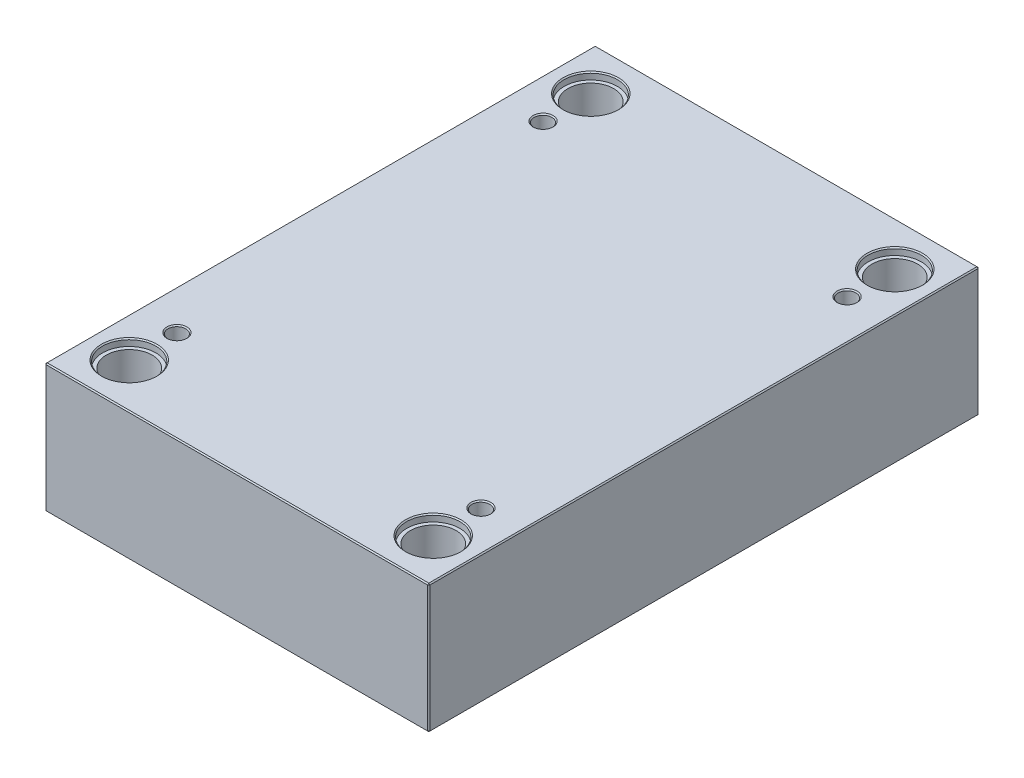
ISO-10303-21;
HEADER;
FILE_DESCRIPTION(('STEP AP214'),'2;1');
FILE_NAME('part.step','',(''),(''),'','','');
FILE_SCHEMA(('AUTOMOTIVE_DESIGN { 1 0 10303 214 1 1 1 1 }'));
ENDSEC;
DATA;
#1=APPLICATION_CONTEXT('core data for automotive mechanical design processes');
#2=APPLICATION_PROTOCOL_DEFINITION('international standard','automotive_design',2000,#1);
#3=PRODUCT_CONTEXT('',#1,'mechanical');
#4=PRODUCT('Part','Part','',(#3));
#5=PRODUCT_RELATED_PRODUCT_CATEGORY('part','',(#4));
#6=PRODUCT_DEFINITION_FORMATION('','',#4);
#7=PRODUCT_DEFINITION_CONTEXT('part definition',#1,'design');
#8=PRODUCT_DEFINITION('design','',#6,#7);
#9=PRODUCT_DEFINITION_SHAPE('','',#8);
#10=(LENGTH_UNIT() NAMED_UNIT(*) SI_UNIT(.MILLI.,.METRE.));
#11=(NAMED_UNIT(*) PLANE_ANGLE_UNIT() SI_UNIT($,.RADIAN.));
#12=(NAMED_UNIT(*) SI_UNIT($,.STERADIAN.) SOLID_ANGLE_UNIT());
#13=UNCERTAINTY_MEASURE_WITH_UNIT(LENGTH_MEASURE(1.E-05),#10,'distance_accuracy_value','');
#14=(GEOMETRIC_REPRESENTATION_CONTEXT(3) GLOBAL_UNCERTAINTY_ASSIGNED_CONTEXT((#13)) GLOBAL_UNIT_ASSIGNED_CONTEXT((#10,
#11,#12)) REPRESENTATION_CONTEXT('',''));
#15=CARTESIAN_POINT('',(0.,0.,0.));
#16=DIRECTION('',(0.,0.,1.));
#17=DIRECTION('',(1.,0.,0.));
#18=AXIS2_PLACEMENT_3D('',#15,#16,#17);
#19=CARTESIAN_POINT('',(-137.,0.,-208.));
#20=DIRECTION('',(0.,1.,0.));
#21=DIRECTION('',(0.,0.,1.));
#22=AXIS2_PLACEMENT_3D('',#19,#20,#21);
#23=CYLINDRICAL_SURFACE('',#22,20.65);
#24=CARTESIAN_POINT('',(-137.,0.999999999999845,-208.));
#25=DIRECTION('',(0.,1.,0.));
#26=DIRECTION('',(0.,0.,1.));
#27=AXIS2_PLACEMENT_3D('',#24,#25,#26);
#28=CIRCLE('',#27,20.65);
#29=CARTESIAN_POINT('',(-137.,0.999999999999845,-187.35));
#30=VERTEX_POINT('',#29);
#31=EDGE_CURVE('E471',#30,#30,#28,.F.);
#32=ORIENTED_EDGE('',*,*,#31,.T.);
#33=EDGE_LOOP('',(#32));
#34=FACE_BOUND('',#33,.T.);
#35=CARTESIAN_POINT('',(-137.,109.7,-208.));
#36=DIRECTION('',(0.,1.,0.));
#37=DIRECTION('',(0.,0.,1.));
#38=AXIS2_PLACEMENT_3D('',#35,#36,#37);
#39=CIRCLE('',#38,20.65);
#40=CARTESIAN_POINT('',(-137.,109.7,-187.35));
#41=VERTEX_POINT('',#40);
#42=EDGE_CURVE('E220',#41,#41,#39,.F.);
#43=ORIENTED_EDGE('',*,*,#42,.F.);
#44=EDGE_LOOP('',(#43));
#45=FACE_BOUND('',#44,.T.);
#46=ADVANCED_FACE('F15',(#34,#45),#23,.F.);
#47=CARTESIAN_POINT('',(137.,0.,-208.));
#48=DIRECTION('',(0.,1.,0.));
#49=DIRECTION('',(0.,0.,1.));
#50=AXIS2_PLACEMENT_3D('',#47,#48,#49);
#51=CYLINDRICAL_SURFACE('',#50,20.65);
#52=CARTESIAN_POINT('',(137.,0.999999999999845,-208.));
#53=DIRECTION('',(0.,1.,0.));
#54=DIRECTION('',(0.,0.,1.));
#55=AXIS2_PLACEMENT_3D('',#52,#53,#54);
#56=CIRCLE('',#55,20.65);
#57=CARTESIAN_POINT('',(137.,0.999999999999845,-187.35));
#58=VERTEX_POINT('',#57);
#59=EDGE_CURVE('E473',#58,#58,#56,.F.);
#60=ORIENTED_EDGE('',*,*,#59,.T.);
#61=EDGE_LOOP('',(#60));
#62=FACE_BOUND('',#61,.T.);
#63=CARTESIAN_POINT('',(137.,109.7,-208.));
#64=DIRECTION('',(0.,1.,0.));
#65=DIRECTION('',(0.,0.,1.));
#66=AXIS2_PLACEMENT_3D('',#63,#64,#65);
#67=CIRCLE('',#66,20.65);
#68=CARTESIAN_POINT('',(137.,109.7,-187.35));
#69=VERTEX_POINT('',#68);
#70=EDGE_CURVE('E217',#69,#69,#67,.F.);
#71=ORIENTED_EDGE('',*,*,#70,.F.);
#72=EDGE_LOOP('',(#71));
#73=FACE_BOUND('',#72,.T.);
#74=ADVANCED_FACE('F262',(#62,#73),#51,.F.);
#75=CARTESIAN_POINT('',(137.,0.,208.));
#76=DIRECTION('',(0.,1.,0.));
#77=DIRECTION('',(0.,0.,1.));
#78=AXIS2_PLACEMENT_3D('',#75,#76,#77);
#79=CYLINDRICAL_SURFACE('',#78,20.65);
#80=CARTESIAN_POINT('',(137.,0.999999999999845,208.));
#81=DIRECTION('',(0.,1.,0.));
#82=DIRECTION('',(0.,0.,1.));
#83=AXIS2_PLACEMENT_3D('',#80,#81,#82);
#84=CIRCLE('',#83,20.65);
#85=CARTESIAN_POINT('',(137.,0.999999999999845,228.65));
#86=VERTEX_POINT('',#85);
#87=EDGE_CURVE('E476',#86,#86,#84,.F.);
#88=ORIENTED_EDGE('',*,*,#87,.T.);
#89=EDGE_LOOP('',(#88));
#90=FACE_BOUND('',#89,.T.);
#91=CARTESIAN_POINT('',(137.,109.7,208.));
#92=DIRECTION('',(0.,1.,0.));
#93=DIRECTION('',(0.,0.,1.));
#94=AXIS2_PLACEMENT_3D('',#91,#92,#93);
#95=CIRCLE('',#94,20.65);
#96=CARTESIAN_POINT('',(137.,109.7,228.65));
#97=VERTEX_POINT('',#96);
#98=EDGE_CURVE('E213',#97,#97,#95,.F.);
#99=ORIENTED_EDGE('',*,*,#98,.F.);
#100=EDGE_LOOP('',(#99));
#101=FACE_BOUND('',#100,.T.);
#102=ADVANCED_FACE('F269',(#90,#101),#79,.F.);
#103=CARTESIAN_POINT('',(-137.,0.,208.));
#104=DIRECTION('',(0.,1.,0.));
#105=DIRECTION('',(0.,0.,1.));
#106=AXIS2_PLACEMENT_3D('',#103,#104,#105);
#107=CYLINDRICAL_SURFACE('',#106,20.65);
#108=CARTESIAN_POINT('',(-137.,0.999999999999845,208.));
#109=DIRECTION('',(0.,1.,0.));
#110=DIRECTION('',(0.,0.,1.));
#111=AXIS2_PLACEMENT_3D('',#108,#109,#110);
#112=CIRCLE('',#111,20.65);
#113=CARTESIAN_POINT('',(-137.,0.999999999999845,228.65));
#114=VERTEX_POINT('',#113);
#115=EDGE_CURVE('E479',#114,#114,#112,.F.);
#116=ORIENTED_EDGE('',*,*,#115,.T.);
#117=EDGE_LOOP('',(#116));
#118=FACE_BOUND('',#117,.T.);
#119=CARTESIAN_POINT('',(-137.,109.7,208.));
#120=DIRECTION('',(0.,1.,0.));
#121=DIRECTION('',(0.,0.,1.));
#122=AXIS2_PLACEMENT_3D('',#119,#120,#121);
#123=CIRCLE('',#122,20.65);
#124=CARTESIAN_POINT('',(-137.,109.7,228.65));
#125=VERTEX_POINT('',#124);
#126=EDGE_CURVE('E210',#125,#125,#123,.F.);
#127=ORIENTED_EDGE('',*,*,#126,.F.);
#128=EDGE_LOOP('',(#127));
#129=FACE_BOUND('',#128,.T.);
#130=ADVANCED_FACE('F276',(#118,#129),#107,.F.);
#131=CARTESIAN_POINT('',(-173.,116.,248.));
#132=DIRECTION('',(1.,0.,0.));
#133=DIRECTION('',(0.,0.,-1.));
#134=AXIS2_PLACEMENT_3D('',#131,#132,#133);
#135=PLANE('',#134);
#136=DIRECTION('',(0.,-1.,0.));
#137=VECTOR('',#136,1.);
#138=CARTESIAN_POINT('',(-173.,116.,-247.));
#139=LINE('',#138,#137);
#140=CARTESIAN_POINT('',(-173.,115.,-247.));
#141=VERTEX_POINT('',#140);
#142=CARTESIAN_POINT('',(-173.,1.,-247.));
#143=VERTEX_POINT('',#142);
#144=EDGE_CURVE('E486',#141,#143,#139,.T.);
#145=ORIENTED_EDGE('',*,*,#144,.T.);
#146=DIRECTION('',(0.,0.,1.));
#147=VECTOR('',#146,1.);
#148=CARTESIAN_POINT('',(-173.,1.,248.));
#149=LINE('',#148,#147);
#150=CARTESIAN_POINT('',(-173.,1.,247.));
#151=VERTEX_POINT('',#150);
#152=EDGE_CURVE('E489',#143,#151,#149,.T.);
#153=ORIENTED_EDGE('',*,*,#152,.T.);
#154=DIRECTION('',(0.,1.,0.));
#155=VECTOR('',#154,1.);
#156=CARTESIAN_POINT('',(-173.,116.,247.));
#157=LINE('',#156,#155);
#158=CARTESIAN_POINT('',(-173.,115.,247.));
#159=VERTEX_POINT('',#158);
#160=EDGE_CURVE('E484',#151,#159,#157,.T.);
#161=ORIENTED_EDGE('',*,*,#160,.T.);
#162=DIRECTION('',(0.,0.,-1.));
#163=VECTOR('',#162,1.);
#164=CARTESIAN_POINT('',(-173.,115.,-248.));
#165=LINE('',#164,#163);
#166=EDGE_CURVE('E482',#159,#141,#165,.T.);
#167=ORIENTED_EDGE('',*,*,#166,.T.);
#168=EDGE_LOOP('',(#145,#153,#161,#167));
#169=FACE_BOUND('',#168,.T.);
#170=ADVANCED_FACE('F297',(#169),#135,.F.);
#171=CARTESIAN_POINT('',(173.,116.,248.));
#172=DIRECTION('',(0.,0.,-1.));
#173=DIRECTION('',(-1.,0.,0.));
#174=AXIS2_PLACEMENT_3D('',#171,#172,#173);
#175=PLANE('',#174);
#176=DIRECTION('',(-1.,0.,0.));
#177=VECTOR('',#176,1.);
#178=CARTESIAN_POINT('',(-173.,115.,248.));
#179=LINE('',#178,#177);
#180=CARTESIAN_POINT('',(172.,115.,248.));
#181=VERTEX_POINT('',#180);
#182=CARTESIAN_POINT('',(-172.,115.,248.));
#183=VERTEX_POINT('',#182);
#184=EDGE_CURVE('E508',#181,#183,#179,.T.);
#185=ORIENTED_EDGE('',*,*,#184,.T.);
#186=DIRECTION('',(0.,-1.,0.));
#187=VECTOR('',#186,1.);
#188=CARTESIAN_POINT('',(-172.,116.,248.));
#189=LINE('',#188,#187);
#190=CARTESIAN_POINT('',(-172.,1.00000000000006,248.));
#191=VERTEX_POINT('',#190);
#192=EDGE_CURVE('E514',#183,#191,#189,.T.);
#193=ORIENTED_EDGE('',*,*,#192,.T.);
#194=DIRECTION('',(1.,0.,0.));
#195=VECTOR('',#194,1.);
#196=CARTESIAN_POINT('',(173.,1.00000000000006,248.));
#197=LINE('',#196,#195);
#198=CARTESIAN_POINT('',(172.,1.00000000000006,248.));
#199=VERTEX_POINT('',#198);
#200=EDGE_CURVE('E512',#191,#199,#197,.T.);
#201=ORIENTED_EDGE('',*,*,#200,.T.);
#202=DIRECTION('',(0.,1.,0.));
#203=VECTOR('',#202,1.);
#204=CARTESIAN_POINT('',(172.,116.,248.));
#205=LINE('',#204,#203);
#206=EDGE_CURVE('E510',#199,#181,#205,.T.);
#207=ORIENTED_EDGE('',*,*,#206,.T.);
#208=EDGE_LOOP('',(#185,#193,#201,#207));
#209=FACE_BOUND('',#208,.T.);
#210=ADVANCED_FACE('F293',(#209),#175,.F.);
#211=CARTESIAN_POINT('',(173.,116.,248.));
#212=DIRECTION('',(-1.,0.,0.));
#213=DIRECTION('',(0.,0.,1.));
#214=AXIS2_PLACEMENT_3D('',#211,#212,#213);
#215=PLANE('',#214);
#216=DIRECTION('',(0.,0.,-1.));
#217=VECTOR('',#216,1.);
#218=CARTESIAN_POINT('',(173.,1.00000000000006,248.));
#219=LINE('',#218,#217);
#220=CARTESIAN_POINT('',(173.,1.00000000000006,247.));
#221=VERTEX_POINT('',#220);
#222=CARTESIAN_POINT('',(173.,1.00000000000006,-247.));
#223=VERTEX_POINT('',#222);
#224=EDGE_CURVE('E503',#221,#223,#219,.T.);
#225=ORIENTED_EDGE('',*,*,#224,.T.);
#226=DIRECTION('',(0.,1.,0.));
#227=VECTOR('',#226,1.);
#228=CARTESIAN_POINT('',(173.,116.,-247.));
#229=LINE('',#228,#227);
#230=CARTESIAN_POINT('',(173.,115.,-247.));
#231=VERTEX_POINT('',#230);
#232=EDGE_CURVE('E505',#223,#231,#229,.T.);
#233=ORIENTED_EDGE('',*,*,#232,.T.);
#234=DIRECTION('',(0.,0.,1.));
#235=VECTOR('',#234,1.);
#236=CARTESIAN_POINT('',(173.,115.,248.));
#237=LINE('',#236,#235);
#238=CARTESIAN_POINT('',(173.,115.,247.));
#239=VERTEX_POINT('',#238);
#240=EDGE_CURVE('E499',#231,#239,#237,.T.);
#241=ORIENTED_EDGE('',*,*,#240,.T.);
#242=DIRECTION('',(0.,-1.,0.));
#243=VECTOR('',#242,1.);
#244=CARTESIAN_POINT('',(173.,116.,247.));
#245=LINE('',#244,#243);
#246=EDGE_CURVE('E501',#239,#221,#245,.T.);
#247=ORIENTED_EDGE('',*,*,#246,.T.);
#248=EDGE_LOOP('',(#225,#233,#241,#247));
#249=FACE_BOUND('',#248,.T.);
#250=ADVANCED_FACE('F289',(#249),#215,.F.);
#251=CARTESIAN_POINT('',(173.,116.,-248.));
#252=DIRECTION('',(0.,0.,1.));
#253=DIRECTION('',(1.,0.,0.));
#254=AXIS2_PLACEMENT_3D('',#251,#252,#253);
#255=PLANE('',#254);
#256=DIRECTION('',(0.,-1.,0.));
#257=VECTOR('',#256,1.);
#258=CARTESIAN_POINT('',(172.,116.,-248.));
#259=LINE('',#258,#257);
#260=CARTESIAN_POINT('',(172.,115.,-248.));
#261=VERTEX_POINT('',#260);
#262=CARTESIAN_POINT('',(172.,1.00000000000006,-248.));
#263=VERTEX_POINT('',#262);
#264=EDGE_CURVE('E493',#261,#263,#259,.T.);
#265=ORIENTED_EDGE('',*,*,#264,.T.);
#266=DIRECTION('',(-1.,0.,0.));
#267=VECTOR('',#266,1.);
#268=CARTESIAN_POINT('',(173.,1.00000000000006,-248.));
#269=LINE('',#268,#267);
#270=CARTESIAN_POINT('',(-172.,1.00000000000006,-248.));
#271=VERTEX_POINT('',#270);
#272=EDGE_CURVE('E137',#263,#271,#269,.T.);
#273=ORIENTED_EDGE('',*,*,#272,.T.);
#274=DIRECTION('',(0.,1.,0.));
#275=VECTOR('',#274,1.);
#276=CARTESIAN_POINT('',(-172.,116.,-248.));
#277=LINE('',#276,#275);
#278=CARTESIAN_POINT('',(-172.,115.,-248.));
#279=VERTEX_POINT('',#278);
#280=EDGE_CURVE('E495',#271,#279,#277,.T.);
#281=ORIENTED_EDGE('',*,*,#280,.T.);
#282=DIRECTION('',(1.,0.,0.));
#283=VECTOR('',#282,1.);
#284=CARTESIAN_POINT('',(173.,115.,-248.));
#285=LINE('',#284,#283);
#286=EDGE_CURVE('E491',#279,#261,#285,.T.);
#287=ORIENTED_EDGE('',*,*,#286,.T.);
#288=EDGE_LOOP('',(#265,#273,#281,#287));
#289=FACE_BOUND('',#288,.T.);
#290=ADVANCED_FACE('F281',(#289),#255,.F.);
#291=CARTESIAN_POINT('',(0.,116.,0.));
#292=DIRECTION('',(0.,1.,0.));
#293=DIRECTION('',(0.,0.,1.));
#294=AXIS2_PLACEMENT_3D('',#291,#292,#293);
#295=PLANE('',#294);
#296=CARTESIAN_POINT('',(137.,116.,208.));
#297=DIRECTION('',(0.,1.,0.));
#298=DIRECTION('',(0.,0.,1.));
#299=AXIS2_PLACEMENT_3D('',#296,#297,#298);
#300=CIRCLE('',#299,25.);
#301=CARTESIAN_POINT('',(137.,116.,233.));
#302=VERTEX_POINT('',#301);
#303=EDGE_CURVE('E235',#302,#302,#300,.F.);
#304=ORIENTED_EDGE('',*,*,#303,.T.);
#305=EDGE_LOOP('',(#304));
#306=FACE_BOUND('',#305,.T.);
#307=CARTESIAN_POINT('',(-137.,116.,208.));
#308=DIRECTION('',(0.,1.,0.));
#309=DIRECTION('',(0.,0.,1.));
#310=AXIS2_PLACEMENT_3D('',#307,#308,#309);
#311=CIRCLE('',#310,25.);
#312=CARTESIAN_POINT('',(-137.,116.,233.));
#313=VERTEX_POINT('',#312);
#314=EDGE_CURVE('E232',#313,#313,#311,.F.);
#315=ORIENTED_EDGE('',*,*,#314,.T.);
#316=EDGE_LOOP('',(#315));
#317=FACE_BOUND('',#316,.T.);
#318=CARTESIAN_POINT('',(137.,116.,-208.));
#319=DIRECTION('',(0.,1.,0.));
#320=DIRECTION('',(0.,0.,1.));
#321=AXIS2_PLACEMENT_3D('',#318,#319,#320);
#322=CIRCLE('',#321,25.);
#323=CARTESIAN_POINT('',(137.,116.,-183.));
#324=VERTEX_POINT('',#323);
#325=EDGE_CURVE('E229',#324,#324,#322,.F.);
#326=ORIENTED_EDGE('',*,*,#325,.T.);
#327=EDGE_LOOP('',(#326));
#328=FACE_BOUND('',#327,.T.);
#329=CARTESIAN_POINT('',(-137.,116.,-208.));
#330=DIRECTION('',(0.,1.,0.));
#331=DIRECTION('',(0.,0.,1.));
#332=AXIS2_PLACEMENT_3D('',#329,#330,#331);
#333=CIRCLE('',#332,25.);
#334=CARTESIAN_POINT('',(-137.,116.,-183.));
#335=VERTEX_POINT('',#334);
#336=EDGE_CURVE('E226',#335,#335,#333,.F.);
#337=ORIENTED_EDGE('',*,*,#336,.T.);
#338=EDGE_LOOP('',(#337));
#339=FACE_BOUND('',#338,.T.);
#340=CARTESIAN_POINT('',(-137.,116.,165.));
#341=DIRECTION('',(0.,1.,0.));
#342=DIRECTION('',(0.,0.,1.));
#343=AXIS2_PLACEMENT_3D('',#340,#341,#342);
#344=CIRCLE('',#343,9.);
#345=CARTESIAN_POINT('',(-137.,116.,174.));
#346=VERTEX_POINT('',#345);
#347=EDGE_CURVE('E197',#346,#346,#344,.F.);
#348=ORIENTED_EDGE('',*,*,#347,.T.);
#349=EDGE_LOOP('',(#348));
#350=FACE_BOUND('',#349,.T.);
#351=CARTESIAN_POINT('',(137.,116.,165.));
#352=DIRECTION('',(0.,1.,0.));
#353=DIRECTION('',(0.,0.,1.));
#354=AXIS2_PLACEMENT_3D('',#351,#352,#353);
#355=CIRCLE('',#354,9.);
#356=CARTESIAN_POINT('',(137.,116.,174.));
#357=VERTEX_POINT('',#356);
#358=EDGE_CURVE('E194',#357,#357,#355,.F.);
#359=ORIENTED_EDGE('',*,*,#358,.T.);
#360=EDGE_LOOP('',(#359));
#361=FACE_BOUND('',#360,.T.);
#362=CARTESIAN_POINT('',(137.,116.,-165.));
#363=DIRECTION('',(0.,1.,0.));
#364=DIRECTION('',(0.,0.,1.));
#365=AXIS2_PLACEMENT_3D('',#362,#363,#364);
#366=CIRCLE('',#365,9.);
#367=CARTESIAN_POINT('',(137.,116.,-156.));
#368=VERTEX_POINT('',#367);
#369=EDGE_CURVE('E191',#368,#368,#366,.F.);
#370=ORIENTED_EDGE('',*,*,#369,.T.);
#371=EDGE_LOOP('',(#370));
#372=FACE_BOUND('',#371,.T.);
#373=CARTESIAN_POINT('',(-137.,116.,-165.));
#374=DIRECTION('',(0.,1.,0.));
#375=DIRECTION('',(0.,0.,1.));
#376=AXIS2_PLACEMENT_3D('',#373,#374,#375);
#377=CIRCLE('',#376,9.);
#378=CARTESIAN_POINT('',(-137.,116.,-156.));
#379=VERTEX_POINT('',#378);
#380=EDGE_CURVE('E187',#379,#379,#377,.F.);
#381=ORIENTED_EDGE('',*,*,#380,.T.);
#382=EDGE_LOOP('',(#381));
#383=FACE_BOUND('',#382,.T.);
#384=DIRECTION('',(0.,0.,-1.));
#385=VECTOR('',#384,1.);
#386=CARTESIAN_POINT('',(172.,116.,-248.));
#387=LINE('',#386,#385);
#388=CARTESIAN_POINT('',(172.,116.,247.));
#389=VERTEX_POINT('',#388);
#390=CARTESIAN_POINT('',(172.,116.,-247.));
#391=VERTEX_POINT('',#390);
#392=EDGE_CURVE('E30',#389,#391,#387,.T.);
#393=ORIENTED_EDGE('',*,*,#392,.T.);
#394=DIRECTION('',(-1.,0.,0.));
#395=VECTOR('',#394,1.);
#396=CARTESIAN_POINT('',(-173.,116.,-247.));
#397=LINE('',#396,#395);
#398=CARTESIAN_POINT('',(-172.,116.,-247.));
#399=VERTEX_POINT('',#398);
#400=EDGE_CURVE('E188',#391,#399,#397,.T.);
#401=ORIENTED_EDGE('',*,*,#400,.T.);
#402=DIRECTION('',(0.,0.,1.));
#403=VECTOR('',#402,1.);
#404=CARTESIAN_POINT('',(-172.,116.,248.));
#405=LINE('',#404,#403);
#406=CARTESIAN_POINT('',(-172.,116.,247.));
#407=VERTEX_POINT('',#406);
#408=EDGE_CURVE('E517',#399,#407,#405,.T.);
#409=ORIENTED_EDGE('',*,*,#408,.T.);
#410=DIRECTION('',(1.,0.,0.));
#411=VECTOR('',#410,1.);
#412=CARTESIAN_POINT('',(173.,116.,247.));
#413=LINE('',#412,#411);
#414=EDGE_CURVE('E35',#407,#389,#413,.T.);
#415=ORIENTED_EDGE('',*,*,#414,.T.);
#416=EDGE_LOOP('',(#393,#401,#409,#415));
#417=FACE_BOUND('',#416,.T.);
#418=ADVANCED_FACE('F278',(#306,#317,#328,#339,#350,#361,#372,#383,#417),#295,.T.);
#419=CARTESIAN_POINT('',(0.,0.,0.));
#420=DIRECTION('',(0.,1.,0.));
#421=DIRECTION('',(0.,0.,1.));
#422=AXIS2_PLACEMENT_3D('',#419,#420,#421);
#423=PLANE('',#422);
#424=CARTESIAN_POINT('',(-137.,0.,-208.));
#425=DIRECTION('',(0.,1.,0.));
#426=DIRECTION('',(0.,0.,1.));
#427=AXIS2_PLACEMENT_3D('',#424,#425,#426);
#428=CIRCLE('',#427,21.65);
#429=CARTESIAN_POINT('',(-137.,0.,-186.35));
#430=VERTEX_POINT('',#429);
#431=EDGE_CURVE('E468',#430,#430,#428,.T.);
#432=ORIENTED_EDGE('',*,*,#431,.T.);
#433=EDGE_LOOP('',(#432));
#434=FACE_BOUND('',#433,.T.);
#435=CARTESIAN_POINT('',(137.,0.,-208.));
#436=DIRECTION('',(0.,1.,0.));
#437=DIRECTION('',(0.,0.,1.));
#438=AXIS2_PLACEMENT_3D('',#435,#436,#437);
#439=CIRCLE('',#438,21.65);
#440=CARTESIAN_POINT('',(137.,0.,-186.35));
#441=VERTEX_POINT('',#440);
#442=EDGE_CURVE('E465',#441,#441,#439,.T.);
#443=ORIENTED_EDGE('',*,*,#442,.T.);
#444=EDGE_LOOP('',(#443));
#445=FACE_BOUND('',#444,.T.);
#446=CARTESIAN_POINT('',(137.,0.,208.));
#447=DIRECTION('',(0.,1.,0.));
#448=DIRECTION('',(0.,0.,1.));
#449=AXIS2_PLACEMENT_3D('',#446,#447,#448);
#450=CIRCLE('',#449,21.65);
#451=CARTESIAN_POINT('',(137.,0.,229.65));
#452=VERTEX_POINT('',#451);
#453=EDGE_CURVE('E462',#452,#452,#450,.T.);
#454=ORIENTED_EDGE('',*,*,#453,.T.);
#455=EDGE_LOOP('',(#454));
#456=FACE_BOUND('',#455,.T.);
#457=CARTESIAN_POINT('',(-137.,0.,208.));
#458=DIRECTION('',(0.,1.,0.));
#459=DIRECTION('',(0.,0.,1.));
#460=AXIS2_PLACEMENT_3D('',#457,#458,#459);
#461=CIRCLE('',#460,21.65);
#462=CARTESIAN_POINT('',(-137.,0.,229.65));
#463=VERTEX_POINT('',#462);
#464=EDGE_CURVE('E459',#463,#463,#461,.T.);
#465=ORIENTED_EDGE('',*,*,#464,.T.);
#466=EDGE_LOOP('',(#465));
#467=FACE_BOUND('',#466,.T.);
#468=DIRECTION('',(0.,0.,1.));
#469=VECTOR('',#468,1.);
#470=CARTESIAN_POINT('',(172.,0.,0.));
#471=LINE('',#470,#469);
#472=CARTESIAN_POINT('',(172.,0.,-247.));
#473=VERTEX_POINT('',#472);
#474=CARTESIAN_POINT('',(172.,0.,247.));
#475=VERTEX_POINT('',#474);
#476=EDGE_CURVE('E107',#473,#475,#471,.T.);
#477=ORIENTED_EDGE('',*,*,#476,.T.);
#478=DIRECTION('',(-1.,0.,0.));
#479=VECTOR('',#478,1.);
#480=CARTESIAN_POINT('',(0.,0.,247.));
#481=LINE('',#480,#479);
#482=CARTESIAN_POINT('',(-172.,0.,247.));
#483=VERTEX_POINT('',#482);
#484=EDGE_CURVE('E457',#475,#483,#481,.T.);
#485=ORIENTED_EDGE('',*,*,#484,.T.);
#486=DIRECTION('',(0.,0.,-1.));
#487=VECTOR('',#486,1.);
#488=CARTESIAN_POINT('',(-172.,0.,0.));
#489=LINE('',#488,#487);
#490=CARTESIAN_POINT('',(-172.,0.,-247.));
#491=VERTEX_POINT('',#490);
#492=EDGE_CURVE('E109',#483,#491,#489,.T.);
#493=ORIENTED_EDGE('',*,*,#492,.T.);
#494=DIRECTION('',(1.,0.,0.));
#495=VECTOR('',#494,1.);
#496=CARTESIAN_POINT('',(0.,0.,-247.));
#497=LINE('',#496,#495);
#498=EDGE_CURVE('E103',#491,#473,#497,.T.);
#499=ORIENTED_EDGE('',*,*,#498,.T.);
#500=EDGE_LOOP('',(#477,#485,#493,#499));
#501=FACE_BOUND('',#500,.T.);
#502=ADVANCED_FACE('F105',(#434,#445,#456,#467,#501),#423,.F.);
#503=CARTESIAN_POINT('',(-137.,0.,-208.));
#504=DIRECTION('',(0.,-1.,0.));
#505=DIRECTION('',(0.,0.,-1.));
#506=AXIS2_PLACEMENT_3D('',#503,#504,#505);
#507=CONICAL_SURFACE('',#506,21.65,0.785398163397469);
#508=ORIENTED_EDGE('',*,*,#31,.F.);
#509=EDGE_LOOP('',(#508));
#510=FACE_BOUND('',#509,.T.);
#511=ORIENTED_EDGE('',*,*,#431,.F.);
#512=EDGE_LOOP('',(#511));
#513=FACE_BOUND('',#512,.T.);
#514=ADVANCED_FACE('F285',(#510,#513),#507,.F.);
#515=CARTESIAN_POINT('',(137.,0.,-208.));
#516=DIRECTION('',(0.,-1.,0.));
#517=DIRECTION('',(0.,0.,-1.));
#518=AXIS2_PLACEMENT_3D('',#515,#516,#517);
#519=CONICAL_SURFACE('',#518,21.65,0.785398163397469);
#520=ORIENTED_EDGE('',*,*,#59,.F.);
#521=EDGE_LOOP('',(#520));
#522=FACE_BOUND('',#521,.T.);
#523=ORIENTED_EDGE('',*,*,#442,.F.);
#524=EDGE_LOOP('',(#523));
#525=FACE_BOUND('',#524,.T.);
#526=ADVANCED_FACE('F304',(#522,#525),#519,.F.);
#527=CARTESIAN_POINT('',(137.,0.,208.));
#528=DIRECTION('',(0.,-1.,0.));
#529=DIRECTION('',(0.,0.,-1.));
#530=AXIS2_PLACEMENT_3D('',#527,#528,#529);
#531=CONICAL_SURFACE('',#530,21.65,0.785398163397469);
#532=ORIENTED_EDGE('',*,*,#87,.F.);
#533=EDGE_LOOP('',(#532));
#534=FACE_BOUND('',#533,.T.);
#535=ORIENTED_EDGE('',*,*,#453,.F.);
#536=EDGE_LOOP('',(#535));
#537=FACE_BOUND('',#536,.T.);
#538=ADVANCED_FACE('F308',(#534,#537),#531,.F.);
#539=CARTESIAN_POINT('',(-137.,0.,208.));
#540=DIRECTION('',(0.,-1.,0.));
#541=DIRECTION('',(0.,0.,-1.));
#542=AXIS2_PLACEMENT_3D('',#539,#540,#541);
#543=CONICAL_SURFACE('',#542,21.65,0.785398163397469);
#544=ORIENTED_EDGE('',*,*,#115,.F.);
#545=EDGE_LOOP('',(#544));
#546=FACE_BOUND('',#545,.T.);
#547=ORIENTED_EDGE('',*,*,#464,.F.);
#548=EDGE_LOOP('',(#547));
#549=FACE_BOUND('',#548,.T.);
#550=ADVANCED_FACE('F312',(#546,#549),#543,.F.);
#551=CARTESIAN_POINT('',(173.,116.,247.));
#552=DIRECTION('',(-0.707106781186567,0.,-0.707106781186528));
#553=DIRECTION('',(0.,-1.,0.));
#554=AXIS2_PLACEMENT_3D('',#551,#552,#553);
#555=PLANE('',#554);
#556=DIRECTION('',(-0.707106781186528,0.,0.707106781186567));
#557=VECTOR('',#556,1.);
#558=CARTESIAN_POINT('',(172.,115.,248.));
#559=LINE('',#558,#557);
#560=EDGE_CURVE('E125',#181,#239,#559,.F.);
#561=ORIENTED_EDGE('',*,*,#560,.F.);
#562=ORIENTED_EDGE('',*,*,#206,.F.);
#563=DIRECTION('',(0.707106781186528,0.,-0.707106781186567));
#564=VECTOR('',#563,1.);
#565=CARTESIAN_POINT('',(172.,1.00000000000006,248.));
#566=LINE('',#565,#564);
#567=EDGE_CURVE('E179',#221,#199,#566,.F.);
#568=ORIENTED_EDGE('',*,*,#567,.F.);
#569=ORIENTED_EDGE('',*,*,#246,.F.);
#570=EDGE_LOOP('',(#561,#562,#568,#569));
#571=FACE_BOUND('',#570,.T.);
#572=ADVANCED_FACE('F316',(#571),#555,.F.);
#573=CARTESIAN_POINT('',(172.,115.,248.));
#574=DIRECTION('',(0.577350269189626,0.577350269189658,0.577350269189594));
#575=DIRECTION('',(-0.707106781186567,0.707106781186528,0.));
#576=AXIS2_PLACEMENT_3D('',#573,#574,#575);
#577=PLANE('',#576);
#578=DIRECTION('',(0.,-0.707106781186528,0.707106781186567));
#579=VECTOR('',#578,1.);
#580=CARTESIAN_POINT('',(172.,115.,248.));
#581=LINE('',#580,#579);
#582=EDGE_CURVE('E174',#181,#389,#581,.F.);
#583=ORIENTED_EDGE('',*,*,#582,.F.);
#584=ORIENTED_EDGE('',*,*,#560,.T.);
#585=DIRECTION('',(-0.707106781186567,0.707106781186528,0.));
#586=VECTOR('',#585,1.);
#587=CARTESIAN_POINT('',(172.5,115.5,247.));
#588=LINE('',#587,#586);
#589=EDGE_CURVE('E176',#389,#239,#588,.F.);
#590=ORIENTED_EDGE('',*,*,#589,.F.);
#591=EDGE_LOOP('',(#583,#584,#590));
#592=FACE_BOUND('',#591,.T.);
#593=ADVANCED_FACE('F384',(#592),#577,.T.);
#594=CARTESIAN_POINT('',(172.,1.00000000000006,248.));
#595=DIRECTION('',(0.577350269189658,-0.577350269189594,0.577350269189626));
#596=DIRECTION('',(0.707106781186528,0.,-0.707106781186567));
#597=AXIS2_PLACEMENT_3D('',#594,#595,#596);
#598=PLANE('',#597);
#599=DIRECTION('',(-0.707106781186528,-0.707106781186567,0.));
#600=VECTOR('',#599,1.);
#601=CARTESIAN_POINT('',(172.5,0.500000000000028,247.));
#602=LINE('',#601,#600);
#603=EDGE_CURVE('E123',#221,#475,#602,.T.);
#604=ORIENTED_EDGE('',*,*,#603,.F.);
#605=ORIENTED_EDGE('',*,*,#567,.T.);
#606=DIRECTION('',(0.,0.707106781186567,0.707106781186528));
#607=VECTOR('',#606,1.);
#608=CARTESIAN_POINT('',(172.,1.00000000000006,248.));
#609=LINE('',#608,#607);
#610=EDGE_CURVE('E171',#475,#199,#609,.T.);
#611=ORIENTED_EDGE('',*,*,#610,.F.);
#612=EDGE_LOOP('',(#604,#605,#611));
#613=FACE_BOUND('',#612,.T.);
#614=ADVANCED_FACE('F380',(#613),#598,.T.);
#615=CARTESIAN_POINT('',(172.,116.,0.));
#616=DIRECTION('',(0.707106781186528,0.707106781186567,0.));
#617=DIRECTION('',(0.,0.,1.));
#618=AXIS2_PLACEMENT_3D('',#615,#616,#617);
#619=PLANE('',#618);
#620=ORIENTED_EDGE('',*,*,#589,.T.);
#621=ORIENTED_EDGE('',*,*,#240,.F.);
#622=DIRECTION('',(0.707106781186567,-0.707106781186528,0.));
#623=VECTOR('',#622,1.);
#624=CARTESIAN_POINT('',(173.,115.,-247.));
#625=LINE('',#624,#623);
#626=EDGE_CURVE('E165',#391,#231,#625,.T.);
#627=ORIENTED_EDGE('',*,*,#626,.F.);
#628=ORIENTED_EDGE('',*,*,#392,.F.);
#629=EDGE_LOOP('',(#620,#621,#627,#628));
#630=FACE_BOUND('',#629,.T.);
#631=ADVANCED_FACE('F376',(#630),#619,.T.);
#632=CARTESIAN_POINT('',(0.,116.,247.));
#633=DIRECTION('',(0.,0.707106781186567,0.707106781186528));
#634=DIRECTION('',(-1.,0.,0.));
#635=AXIS2_PLACEMENT_3D('',#632,#633,#634);
#636=PLANE('',#635);
#637=ORIENTED_EDGE('',*,*,#582,.T.);
#638=ORIENTED_EDGE('',*,*,#414,.F.);
#639=DIRECTION('',(0.,0.707106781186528,-0.707106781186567));
#640=VECTOR('',#639,1.);
#641=CARTESIAN_POINT('',(-172.,115.5,247.5));
#642=LINE('',#641,#640);
#643=EDGE_CURVE('E162',#183,#407,#642,.T.);
#644=ORIENTED_EDGE('',*,*,#643,.F.);
#645=ORIENTED_EDGE('',*,*,#184,.F.);
#646=EDGE_LOOP('',(#637,#638,#644,#645));
#647=FACE_BOUND('',#646,.T.);
#648=ADVANCED_FACE('F372',(#647),#636,.T.);
#649=CARTESIAN_POINT('',(-172.,116.,248.));
#650=DIRECTION('',(0.707106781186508,0.,-0.707106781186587));
#651=DIRECTION('',(0.,-1.,0.));
#652=AXIS2_PLACEMENT_3D('',#649,#650,#651);
#653=PLANE('',#652);
#654=DIRECTION('',(0.707106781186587,0.,0.707106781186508));
#655=VECTOR('',#654,1.);
#656=CARTESIAN_POINT('',(-172.,1.00000000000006,248.));
#657=LINE('',#656,#655);
#658=EDGE_CURVE('E156',#191,#151,#657,.F.);
#659=ORIENTED_EDGE('',*,*,#658,.F.);
#660=ORIENTED_EDGE('',*,*,#192,.F.);
#661=DIRECTION('',(-0.707106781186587,0.,-0.707106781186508));
#662=VECTOR('',#661,1.);
#663=CARTESIAN_POINT('',(-173.,115.,247.));
#664=LINE('',#663,#662);
#665=EDGE_CURVE('E159',#159,#183,#664,.F.);
#666=ORIENTED_EDGE('',*,*,#665,.F.);
#667=ORIENTED_EDGE('',*,*,#160,.F.);
#668=EDGE_LOOP('',(#659,#660,#666,#667));
#669=FACE_BOUND('',#668,.T.);
#670=ADVANCED_FACE('F368',(#669),#653,.F.);
#671=CARTESIAN_POINT('',(173.,1.00000000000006,248.));
#672=DIRECTION('',(0.,0.707106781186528,-0.707106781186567));
#673=DIRECTION('',(1.,0.,0.));
#674=AXIS2_PLACEMENT_3D('',#671,#672,#673);
#675=PLANE('',#674);
#676=ORIENTED_EDGE('',*,*,#610,.T.);
#677=ORIENTED_EDGE('',*,*,#200,.F.);
#678=DIRECTION('',(0.,-0.707106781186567,-0.707106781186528));
#679=VECTOR('',#678,1.);
#680=CARTESIAN_POINT('',(-172.,1.00000000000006,248.));
#681=LINE('',#680,#679);
#682=EDGE_CURVE('E134',#483,#191,#681,.F.);
#683=ORIENTED_EDGE('',*,*,#682,.F.);
#684=ORIENTED_EDGE('',*,*,#484,.F.);
#685=EDGE_LOOP('',(#676,#677,#683,#684));
#686=FACE_BOUND('',#685,.T.);
#687=ADVANCED_FACE('F365',(#686),#675,.F.);
#688=CARTESIAN_POINT('',(173.,1.00000000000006,248.));
#689=DIRECTION('',(-0.707106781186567,0.707106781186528,0.));
#690=DIRECTION('',(0.,0.,-1.));
#691=AXIS2_PLACEMENT_3D('',#688,#689,#690);
#692=PLANE('',#691);
#693=ORIENTED_EDGE('',*,*,#603,.T.);
#694=ORIENTED_EDGE('',*,*,#476,.F.);
#695=DIRECTION('',(0.707106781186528,0.707106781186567,0.));
#696=VECTOR('',#695,1.);
#697=CARTESIAN_POINT('',(172.5,0.5,-247.));
#698=LINE('',#697,#696);
#699=EDGE_CURVE('E120',#223,#473,#698,.F.);
#700=ORIENTED_EDGE('',*,*,#699,.F.);
#701=ORIENTED_EDGE('',*,*,#224,.F.);
#702=EDGE_LOOP('',(#693,#694,#700,#701));
#703=FACE_BOUND('',#702,.T.);
#704=ADVANCED_FACE('F118',(#703),#692,.F.);
#705=CARTESIAN_POINT('',(172.,116.,-248.));
#706=DIRECTION('',(-0.707106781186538,0.,0.707106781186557));
#707=DIRECTION('',(0.,-1.,0.));
#708=AXIS2_PLACEMENT_3D('',#705,#706,#707);
#709=PLANE('',#708);
#710=DIRECTION('',(0.707106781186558,0.,0.707106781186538));
#711=VECTOR('',#710,1.);
#712=CARTESIAN_POINT('',(173.,115.,-247.));
#713=LINE('',#712,#711);
#714=EDGE_CURVE('E167',#231,#261,#713,.F.);
#715=ORIENTED_EDGE('',*,*,#714,.F.);
#716=ORIENTED_EDGE('',*,*,#232,.F.);
#717=DIRECTION('',(-0.707106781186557,0.,-0.707106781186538));
#718=VECTOR('',#717,1.);
#719=CARTESIAN_POINT('',(172.,1.00000000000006,-248.));
#720=LINE('',#719,#718);
#721=EDGE_CURVE('E133',#263,#223,#720,.F.);
#722=ORIENTED_EDGE('',*,*,#721,.F.);
#723=ORIENTED_EDGE('',*,*,#264,.F.);
#724=EDGE_LOOP('',(#715,#716,#722,#723));
#725=FACE_BOUND('',#724,.T.);
#726=ADVANCED_FACE('F358',(#725),#709,.F.);
#727=CARTESIAN_POINT('',(173.,115.,-247.));
#728=DIRECTION('',(0.57735026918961,0.577350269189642,-0.577350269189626));
#729=DIRECTION('',(0.,0.707106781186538,0.707106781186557));
#730=AXIS2_PLACEMENT_3D('',#727,#728,#729);
#731=PLANE('',#730);
#732=ORIENTED_EDGE('',*,*,#626,.T.);
#733=ORIENTED_EDGE('',*,*,#714,.T.);
#734=DIRECTION('',(0.,0.707106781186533,0.707106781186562));
#735=VECTOR('',#734,1.);
#736=CARTESIAN_POINT('',(172.,115.5,-247.5));
#737=LINE('',#736,#735);
#738=EDGE_CURVE('E151',#391,#261,#737,.F.);
#739=ORIENTED_EDGE('',*,*,#738,.F.);
#740=EDGE_LOOP('',(#732,#733,#739));
#741=FACE_BOUND('',#740,.T.);
#742=ADVANCED_FACE('F354',(#741),#731,.T.);
#743=CARTESIAN_POINT('',(-173.,115.,247.));
#744=DIRECTION('',(-0.577350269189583,0.577350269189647,0.577350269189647));
#745=DIRECTION('',(0.,-0.707106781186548,0.707106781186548));
#746=AXIS2_PLACEMENT_3D('',#743,#744,#745);
#747=PLANE('',#746);
#748=ORIENTED_EDGE('',*,*,#665,.T.);
#749=ORIENTED_EDGE('',*,*,#643,.T.);
#750=DIRECTION('',(-0.707106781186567,-0.707106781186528,0.));
#751=VECTOR('',#750,1.);
#752=CARTESIAN_POINT('',(-173.,115.,247.));
#753=LINE('',#752,#751);
#754=EDGE_CURVE('E142',#159,#407,#753,.F.);
#755=ORIENTED_EDGE('',*,*,#754,.F.);
#756=EDGE_LOOP('',(#748,#749,#755));
#757=FACE_BOUND('',#756,.T.);
#758=ADVANCED_FACE('F350',(#757),#747,.T.);
#759=CARTESIAN_POINT('',(-172.,1.00000000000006,248.));
#760=DIRECTION('',(-0.577350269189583,-0.577350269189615,0.577350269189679));
#761=DIRECTION('',(0.,-0.707106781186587,-0.707106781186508));
#762=AXIS2_PLACEMENT_3D('',#759,#760,#761);
#763=PLANE('',#762);
#764=ORIENTED_EDGE('',*,*,#682,.T.);
#765=ORIENTED_EDGE('',*,*,#658,.T.);
#766=DIRECTION('',(-0.707106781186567,0.707106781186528,0.));
#767=VECTOR('',#766,1.);
#768=CARTESIAN_POINT('',(-172.5,0.499999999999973,247.));
#769=LINE('',#768,#767);
#770=EDGE_CURVE('E138',#483,#151,#769,.T.);
#771=ORIENTED_EDGE('',*,*,#770,.F.);
#772=EDGE_LOOP('',(#764,#765,#771));
#773=FACE_BOUND('',#772,.T.);
#774=ADVANCED_FACE('F347',(#773),#763,.T.);
#775=CARTESIAN_POINT('',(172.,1.00000000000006,-248.));
#776=DIRECTION('',(0.577350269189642,-0.577350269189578,-0.577350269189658));
#777=DIRECTION('',(-0.707106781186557,0.,-0.707106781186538));
#778=AXIS2_PLACEMENT_3D('',#775,#776,#777);
#779=PLANE('',#778);
#780=ORIENTED_EDGE('',*,*,#721,.T.);
#781=ORIENTED_EDGE('',*,*,#699,.T.);
#782=DIRECTION('',(0.,-0.707106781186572,0.707106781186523));
#783=VECTOR('',#782,1.);
#784=CARTESIAN_POINT('',(172.,1.00000000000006,-248.));
#785=LINE('',#784,#783);
#786=EDGE_CURVE('E130',#263,#473,#785,.T.);
#787=ORIENTED_EDGE('',*,*,#786,.F.);
#788=EDGE_LOOP('',(#780,#781,#787));
#789=FACE_BOUND('',#788,.T.);
#790=ADVANCED_FACE('F129',(#789),#779,.T.);
#791=CARTESIAN_POINT('',(0.,116.,-247.));
#792=DIRECTION('',(0.,0.707106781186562,-0.707106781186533));
#793=DIRECTION('',(1.,0.,0.));
#794=AXIS2_PLACEMENT_3D('',#791,#792,#793);
#795=PLANE('',#794);
#796=ORIENTED_EDGE('',*,*,#738,.T.);
#797=ORIENTED_EDGE('',*,*,#286,.F.);
#798=DIRECTION('',(0.,-0.707106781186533,-0.707106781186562));
#799=VECTOR('',#798,1.);
#800=CARTESIAN_POINT('',(-172.,115.,-248.));
#801=LINE('',#800,#799);
#802=EDGE_CURVE('E139',#399,#279,#801,.T.);
#803=ORIENTED_EDGE('',*,*,#802,.F.);
#804=ORIENTED_EDGE('',*,*,#400,.F.);
#805=EDGE_LOOP('',(#796,#797,#803,#804));
#806=FACE_BOUND('',#805,.T.);
#807=ADVANCED_FACE('F340',(#806),#795,.T.);
#808=CARTESIAN_POINT('',(-172.,116.,0.));
#809=DIRECTION('',(-0.707106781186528,0.707106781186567,0.));
#810=DIRECTION('',(0.,0.,-1.));
#811=AXIS2_PLACEMENT_3D('',#808,#809,#810);
#812=PLANE('',#811);
#813=ORIENTED_EDGE('',*,*,#754,.T.);
#814=ORIENTED_EDGE('',*,*,#408,.F.);
#815=DIRECTION('',(0.707106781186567,0.707106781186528,0.));
#816=VECTOR('',#815,1.);
#817=CARTESIAN_POINT('',(-172.5,115.5,-247.));
#818=LINE('',#817,#816);
#819=EDGE_CURVE('E145',#141,#399,#818,.T.);
#820=ORIENTED_EDGE('',*,*,#819,.F.);
#821=ORIENTED_EDGE('',*,*,#166,.F.);
#822=EDGE_LOOP('',(#813,#814,#820,#821));
#823=FACE_BOUND('',#822,.T.);
#824=ADVANCED_FACE('F336',(#823),#812,.T.);
#825=CARTESIAN_POINT('',(-173.,1.,248.));
#826=DIRECTION('',(0.707106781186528,0.707106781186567,0.));
#827=DIRECTION('',(0.,0.,1.));
#828=AXIS2_PLACEMENT_3D('',#825,#826,#827);
#829=PLANE('',#828);
#830=ORIENTED_EDGE('',*,*,#770,.T.);
#831=ORIENTED_EDGE('',*,*,#152,.F.);
#832=DIRECTION('',(0.707106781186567,-0.707106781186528,0.));
#833=VECTOR('',#832,1.);
#834=CARTESIAN_POINT('',(-173.,1.,-247.));
#835=LINE('',#834,#833);
#836=EDGE_CURVE('E528',#491,#143,#835,.F.);
#837=ORIENTED_EDGE('',*,*,#836,.F.);
#838=ORIENTED_EDGE('',*,*,#492,.F.);
#839=EDGE_LOOP('',(#830,#831,#837,#838));
#840=FACE_BOUND('',#839,.T.);
#841=ADVANCED_FACE('F333',(#840),#829,.F.);
#842=CARTESIAN_POINT('',(173.,1.00000000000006,-248.));
#843=DIRECTION('',(0.,0.707106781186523,0.707106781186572));
#844=DIRECTION('',(-1.,0.,0.));
#845=AXIS2_PLACEMENT_3D('',#842,#843,#844);
#846=PLANE('',#845);
#847=ORIENTED_EDGE('',*,*,#786,.T.);
#848=ORIENTED_EDGE('',*,*,#498,.F.);
#849=DIRECTION('',(0.,0.707106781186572,-0.707106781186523));
#850=VECTOR('',#849,1.);
#851=CARTESIAN_POINT('',(-172.,0.500000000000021,-247.5));
#852=LINE('',#851,#850);
#853=EDGE_CURVE('E525',#271,#491,#852,.F.);
#854=ORIENTED_EDGE('',*,*,#853,.F.);
#855=ORIENTED_EDGE('',*,*,#272,.F.);
#856=EDGE_LOOP('',(#847,#848,#854,#855));
#857=FACE_BOUND('',#856,.T.);
#858=ADVANCED_FACE('F136',(#857),#846,.F.);
#859=CARTESIAN_POINT('',(-172.,115.,-248.));
#860=DIRECTION('',(-0.577350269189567,0.577350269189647,-0.577350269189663));
#861=DIRECTION('',(0.,0.707106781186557,0.707106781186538));
#862=AXIS2_PLACEMENT_3D('',#859,#860,#861);
#863=PLANE('',#862);
#864=ORIENTED_EDGE('',*,*,#819,.T.);
#865=ORIENTED_EDGE('',*,*,#802,.T.);
#866=DIRECTION('',(0.707106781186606,0.,-0.707106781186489));
#867=VECTOR('',#866,1.);
#868=CARTESIAN_POINT('',(-172.,115.,-248.));
#869=LINE('',#868,#867);
#870=EDGE_CURVE('E523',#141,#279,#869,.T.);
#871=ORIENTED_EDGE('',*,*,#870,.F.);
#872=EDGE_LOOP('',(#864,#865,#871));
#873=FACE_BOUND('',#872,.T.);
#874=ADVANCED_FACE('F326',(#873),#863,.T.);
#875=CARTESIAN_POINT('',(-173.,1.,-247.));
#876=DIRECTION('',(-0.577350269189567,-0.577350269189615,-0.577350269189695));
#877=DIRECTION('',(0.,0.707106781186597,-0.707106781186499));
#878=AXIS2_PLACEMENT_3D('',#875,#876,#877);
#879=PLANE('',#878);
#880=ORIENTED_EDGE('',*,*,#853,.T.);
#881=ORIENTED_EDGE('',*,*,#836,.T.);
#882=DIRECTION('',(-0.707106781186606,0.,0.707106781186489));
#883=VECTOR('',#882,1.);
#884=CARTESIAN_POINT('',(-173.,1.,-247.));
#885=LINE('',#884,#883);
#886=EDGE_CURVE('E454',#271,#143,#885,.T.);
#887=ORIENTED_EDGE('',*,*,#886,.F.);
#888=EDGE_LOOP('',(#880,#881,#887));
#889=FACE_BOUND('',#888,.T.);
#890=ADVANCED_FACE('F322',(#889),#879,.T.);
#891=CARTESIAN_POINT('',(-173.,116.,-247.));
#892=DIRECTION('',(0.707106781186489,0.,0.707106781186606));
#893=DIRECTION('',(0.,-1.,0.));
#894=AXIS2_PLACEMENT_3D('',#891,#892,#893);
#895=PLANE('',#894);
#896=ORIENTED_EDGE('',*,*,#870,.T.);
#897=ORIENTED_EDGE('',*,*,#280,.F.);
#898=ORIENTED_EDGE('',*,*,#886,.T.);
#899=ORIENTED_EDGE('',*,*,#144,.F.);
#900=EDGE_LOOP('',(#896,#897,#898,#899));
#901=FACE_BOUND('',#900,.T.);
#902=ADVANCED_FACE('F318',(#901),#895,.F.);
#903=CARTESIAN_POINT('',(-137.,91.,-165.));
#904=DIRECTION('',(0.,1.,0.));
#905=DIRECTION('',(0.,0.,1.));
#906=AXIS2_PLACEMENT_3D('',#903,#904,#905);
#907=CYLINDRICAL_SURFACE('',#906,8.);
#908=CARTESIAN_POINT('',(-137.,115.,-165.));
#909=DIRECTION('',(0.,1.,0.));
#910=DIRECTION('',(0.,0.,1.));
#911=AXIS2_PLACEMENT_3D('',#908,#909,#910);
#912=CIRCLE('',#911,8.);
#913=CARTESIAN_POINT('',(-137.,115.,-157.));
#914=VERTEX_POINT('',#913);
#915=EDGE_CURVE('E206',#914,#914,#912,.T.);
#916=ORIENTED_EDGE('',*,*,#915,.T.);
#917=EDGE_LOOP('',(#916));
#918=FACE_BOUND('',#917,.T.);
#919=CARTESIAN_POINT('',(-137.,91.,-165.));
#920=DIRECTION('',(0.,1.,0.));
#921=DIRECTION('',(0.,0.,1.));
#922=AXIS2_PLACEMENT_3D('',#919,#920,#921);
#923=CIRCLE('',#922,8.);
#924=CARTESIAN_POINT('',(-137.,91.,-157.));
#925=VERTEX_POINT('',#924);
#926=EDGE_CURVE('E447',#925,#925,#923,.T.);
#927=ORIENTED_EDGE('',*,*,#926,.F.);
#928=EDGE_LOOP('',(#927));
#929=FACE_BOUND('',#928,.T.);
#930=ADVANCED_FACE('F321',(#918,#929),#907,.F.);
#931=CARTESIAN_POINT('',(-137.,91.,-165.));
#932=DIRECTION('',(0.,1.,0.));
#933=DIRECTION('',(0.,0.,1.));
#934=AXIS2_PLACEMENT_3D('',#931,#932,#933);
#935=PLANE('',#934);
#936=ORIENTED_EDGE('',*,*,#926,.T.);
#937=EDGE_LOOP('',(#936));
#938=FACE_BOUND('',#937,.T.);
#939=ADVANCED_FACE('F595',(#938),#935,.T.);
#940=CARTESIAN_POINT('',(137.,91.,-165.));
#941=DIRECTION('',(0.,1.,0.));
#942=DIRECTION('',(0.,0.,1.));
#943=AXIS2_PLACEMENT_3D('',#940,#941,#942);
#944=CYLINDRICAL_SURFACE('',#943,8.);
#945=CARTESIAN_POINT('',(137.,115.,-165.));
#946=DIRECTION('',(0.,1.,0.));
#947=DIRECTION('',(0.,0.,1.));
#948=AXIS2_PLACEMENT_3D('',#945,#946,#947);
#949=CIRCLE('',#948,8.);
#950=CARTESIAN_POINT('',(137.,115.,-157.));
#951=VERTEX_POINT('',#950);
#952=EDGE_CURVE('E203',#951,#951,#949,.T.);
#953=ORIENTED_EDGE('',*,*,#952,.T.);
#954=EDGE_LOOP('',(#953));
#955=FACE_BOUND('',#954,.T.);
#956=CARTESIAN_POINT('',(137.,91.,-165.));
#957=DIRECTION('',(0.,1.,0.));
#958=DIRECTION('',(0.,0.,1.));
#959=AXIS2_PLACEMENT_3D('',#956,#957,#958);
#960=CIRCLE('',#959,8.);
#961=CARTESIAN_POINT('',(137.,91.,-157.));
#962=VERTEX_POINT('',#961);
#963=EDGE_CURVE('E444',#962,#962,#960,.T.);
#964=ORIENTED_EDGE('',*,*,#963,.F.);
#965=EDGE_LOOP('',(#964));
#966=FACE_BOUND('',#965,.T.);
#967=ADVANCED_FACE('F591',(#955,#966),#944,.F.);
#968=CARTESIAN_POINT('',(137.,91.,-165.));
#969=DIRECTION('',(0.,1.,0.));
#970=DIRECTION('',(0.,0.,1.));
#971=AXIS2_PLACEMENT_3D('',#968,#969,#970);
#972=PLANE('',#971);
#973=ORIENTED_EDGE('',*,*,#963,.T.);
#974=EDGE_LOOP('',(#973));
#975=FACE_BOUND('',#974,.T.);
#976=ADVANCED_FACE('F587',(#975),#972,.T.);
#977=CARTESIAN_POINT('',(137.,91.,165.));
#978=DIRECTION('',(0.,1.,0.));
#979=DIRECTION('',(0.,0.,1.));
#980=AXIS2_PLACEMENT_3D('',#977,#978,#979);
#981=CYLINDRICAL_SURFACE('',#980,8.);
#982=CARTESIAN_POINT('',(137.,115.,165.));
#983=DIRECTION('',(0.,1.,0.));
#984=DIRECTION('',(0.,0.,1.));
#985=AXIS2_PLACEMENT_3D('',#982,#983,#984);
#986=CIRCLE('',#985,8.);
#987=CARTESIAN_POINT('',(137.,115.,173.));
#988=VERTEX_POINT('',#987);
#989=EDGE_CURVE('E200',#988,#988,#986,.T.);
#990=ORIENTED_EDGE('',*,*,#989,.T.);
#991=EDGE_LOOP('',(#990));
#992=FACE_BOUND('',#991,.T.);
#993=CARTESIAN_POINT('',(137.,91.,165.));
#994=DIRECTION('',(0.,1.,0.));
#995=DIRECTION('',(0.,0.,1.));
#996=AXIS2_PLACEMENT_3D('',#993,#994,#995);
#997=CIRCLE('',#996,8.);
#998=CARTESIAN_POINT('',(137.,91.,173.));
#999=VERTEX_POINT('',#998);
#1000=EDGE_CURVE('E448',#999,#999,#997,.T.);
#1001=ORIENTED_EDGE('',*,*,#1000,.F.);
#1002=EDGE_LOOP('',(#1001));
#1003=FACE_BOUND('',#1002,.T.);
#1004=ADVANCED_FACE('F590',(#992,#1003),#981,.F.);
#1005=CARTESIAN_POINT('',(137.,91.,165.));
#1006=DIRECTION('',(0.,1.,0.));
#1007=DIRECTION('',(0.,0.,1.));
#1008=AXIS2_PLACEMENT_3D('',#1005,#1006,#1007);
#1009=PLANE('',#1008);
#1010=ORIENTED_EDGE('',*,*,#1000,.T.);
#1011=EDGE_LOOP('',(#1010));
#1012=FACE_BOUND('',#1011,.T.);
#1013=ADVANCED_FACE('F597',(#1012),#1009,.T.);
#1014=CARTESIAN_POINT('',(-137.,91.,165.));
#1015=DIRECTION('',(0.,1.,0.));
#1016=DIRECTION('',(0.,0.,1.));
#1017=AXIS2_PLACEMENT_3D('',#1014,#1015,#1016);
#1018=CYLINDRICAL_SURFACE('',#1017,8.);
#1019=CARTESIAN_POINT('',(-137.,115.,165.));
#1020=DIRECTION('',(0.,1.,0.));
#1021=DIRECTION('',(0.,0.,1.));
#1022=AXIS2_PLACEMENT_3D('',#1019,#1020,#1021);
#1023=CIRCLE('',#1022,8.);
#1024=CARTESIAN_POINT('',(-137.,115.,173.));
#1025=VERTEX_POINT('',#1024);
#1026=EDGE_CURVE('E184',#1025,#1025,#1023,.T.);
#1027=ORIENTED_EDGE('',*,*,#1026,.T.);
#1028=EDGE_LOOP('',(#1027));
#1029=FACE_BOUND('',#1028,.T.);
#1030=CARTESIAN_POINT('',(-137.,91.,165.));
#1031=DIRECTION('',(0.,1.,0.));
#1032=DIRECTION('',(0.,0.,1.));
#1033=AXIS2_PLACEMENT_3D('',#1030,#1031,#1032);
#1034=CIRCLE('',#1033,8.);
#1035=CARTESIAN_POINT('',(-137.,91.,173.));
#1036=VERTEX_POINT('',#1035);
#1037=EDGE_CURVE('E223',#1036,#1036,#1034,.T.);
#1038=ORIENTED_EDGE('',*,*,#1037,.F.);
#1039=EDGE_LOOP('',(#1038));
#1040=FACE_BOUND('',#1039,.T.);
#1041=ADVANCED_FACE('F600',(#1029,#1040),#1018,.F.);
#1042=CARTESIAN_POINT('',(-137.,91.,165.));
#1043=DIRECTION('',(0.,1.,0.));
#1044=DIRECTION('',(0.,0.,1.));
#1045=AXIS2_PLACEMENT_3D('',#1042,#1043,#1044);
#1046=PLANE('',#1045);
#1047=ORIENTED_EDGE('',*,*,#1037,.T.);
#1048=EDGE_LOOP('',(#1047));
#1049=FACE_BOUND('',#1048,.T.);
#1050=ADVANCED_FACE('F396',(#1049),#1046,.T.);
#1051=CARTESIAN_POINT('',(-137.,115.,165.));
#1052=DIRECTION('',(0.,1.,0.));
#1053=DIRECTION('',(0.,0.,1.));
#1054=AXIS2_PLACEMENT_3D('',#1051,#1052,#1053);
#1055=CONICAL_SURFACE('',#1054,8.,0.785398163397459);
#1056=ORIENTED_EDGE('',*,*,#347,.F.);
#1057=EDGE_LOOP('',(#1056));
#1058=FACE_BOUND('',#1057,.T.);
#1059=ORIENTED_EDGE('',*,*,#1026,.F.);
#1060=EDGE_LOOP('',(#1059));
#1061=FACE_BOUND('',#1060,.T.);
#1062=ADVANCED_FACE('F392',(#1058,#1061),#1055,.F.);
#1063=CARTESIAN_POINT('',(137.,115.,165.));
#1064=DIRECTION('',(0.,1.,0.));
#1065=DIRECTION('',(0.,0.,1.));
#1066=AXIS2_PLACEMENT_3D('',#1063,#1064,#1065);
#1067=CONICAL_SURFACE('',#1066,8.,0.785398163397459);
#1068=ORIENTED_EDGE('',*,*,#358,.F.);
#1069=EDGE_LOOP('',(#1068));
#1070=FACE_BOUND('',#1069,.T.);
#1071=ORIENTED_EDGE('',*,*,#989,.F.);
#1072=EDGE_LOOP('',(#1071));
#1073=FACE_BOUND('',#1072,.T.);
#1074=ADVANCED_FACE('F395',(#1070,#1073),#1067,.F.);
#1075=CARTESIAN_POINT('',(137.,115.,-165.));
#1076=DIRECTION('',(0.,1.,0.));
#1077=DIRECTION('',(0.,0.,1.));
#1078=AXIS2_PLACEMENT_3D('',#1075,#1076,#1077);
#1079=CONICAL_SURFACE('',#1078,8.,0.785398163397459);
#1080=ORIENTED_EDGE('',*,*,#369,.F.);
#1081=EDGE_LOOP('',(#1080));
#1082=FACE_BOUND('',#1081,.T.);
#1083=ORIENTED_EDGE('',*,*,#952,.F.);
#1084=EDGE_LOOP('',(#1083));
#1085=FACE_BOUND('',#1084,.T.);
#1086=ADVANCED_FACE('F400',(#1082,#1085),#1079,.F.);
#1087=CARTESIAN_POINT('',(-137.,115.,-165.));
#1088=DIRECTION('',(0.,1.,0.));
#1089=DIRECTION('',(0.,0.,1.));
#1090=AXIS2_PLACEMENT_3D('',#1087,#1088,#1089);
#1091=CONICAL_SURFACE('',#1090,8.,0.785398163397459);
#1092=ORIENTED_EDGE('',*,*,#380,.F.);
#1093=EDGE_LOOP('',(#1092));
#1094=FACE_BOUND('',#1093,.T.);
#1095=ORIENTED_EDGE('',*,*,#915,.F.);
#1096=EDGE_LOOP('',(#1095));
#1097=FACE_BOUND('',#1096,.T.);
#1098=ADVANCED_FACE('F404',(#1094,#1097),#1091,.F.);
#1099=CARTESIAN_POINT('',(-137.,109.7,208.));
#1100=DIRECTION('',(0.,1.,0.));
#1101=DIRECTION('',(0.,0.,1.));
#1102=AXIS2_PLACEMENT_3D('',#1099,#1100,#1101);
#1103=PLANE('',#1102);
#1104=CARTESIAN_POINT('',(-137.,109.7,208.));
#1105=DIRECTION('',(0.,1.,0.));
#1106=DIRECTION('',(0.,0.,1.));
#1107=AXIS2_PLACEMENT_3D('',#1104,#1105,#1106);
#1108=CIRCLE('',#1107,24.);
#1109=CARTESIAN_POINT('',(-137.,109.7,232.));
#1110=VERTEX_POINT('',#1109);
#1111=EDGE_CURVE('E435',#1110,#1110,#1108,.T.);
#1112=ORIENTED_EDGE('',*,*,#1111,.T.);
#1113=EDGE_LOOP('',(#1112));
#1114=FACE_BOUND('',#1113,.T.);
#1115=ORIENTED_EDGE('',*,*,#126,.T.);
#1116=EDGE_LOOP('',(#1115));
#1117=FACE_BOUND('',#1116,.T.);
#1118=ADVANCED_FACE('F408',(#1114,#1117),#1103,.T.);
#1119=CARTESIAN_POINT('',(-137.,109.7,208.));
#1120=DIRECTION('',(0.,1.,0.));
#1121=DIRECTION('',(0.,0.,1.));
#1122=AXIS2_PLACEMENT_3D('',#1119,#1120,#1121);
#1123=CYLINDRICAL_SURFACE('',#1122,24.);
#1124=CARTESIAN_POINT('',(-137.,115.,208.));
#1125=DIRECTION('',(0.,1.,0.));
#1126=DIRECTION('',(0.,0.,1.));
#1127=AXIS2_PLACEMENT_3D('',#1124,#1125,#1126);
#1128=CIRCLE('',#1127,24.);
#1129=CARTESIAN_POINT('',(-137.,115.,232.));
#1130=VERTEX_POINT('',#1129);
#1131=EDGE_CURVE('E238',#1130,#1130,#1128,.T.);
#1132=ORIENTED_EDGE('',*,*,#1131,.T.);
#1133=EDGE_LOOP('',(#1132));
#1134=FACE_BOUND('',#1133,.T.);
#1135=ORIENTED_EDGE('',*,*,#1111,.F.);
#1136=EDGE_LOOP('',(#1135));
#1137=FACE_BOUND('',#1136,.T.);
#1138=ADVANCED_FACE('F573',(#1134,#1137),#1123,.F.);
#1139=CARTESIAN_POINT('',(137.,109.7,208.));
#1140=DIRECTION('',(0.,1.,0.));
#1141=DIRECTION('',(0.,0.,1.));
#1142=AXIS2_PLACEMENT_3D('',#1139,#1140,#1141);
#1143=PLANE('',#1142);
#1144=CARTESIAN_POINT('',(137.,109.7,208.));
#1145=DIRECTION('',(0.,1.,0.));
#1146=DIRECTION('',(0.,0.,1.));
#1147=AXIS2_PLACEMENT_3D('',#1144,#1145,#1146);
#1148=CIRCLE('',#1147,24.);
#1149=CARTESIAN_POINT('',(137.,109.7,232.));
#1150=VERTEX_POINT('',#1149);
#1151=EDGE_CURVE('E432',#1150,#1150,#1148,.T.);
#1152=ORIENTED_EDGE('',*,*,#1151,.T.);
#1153=EDGE_LOOP('',(#1152));
#1154=FACE_BOUND('',#1153,.T.);
#1155=ORIENTED_EDGE('',*,*,#98,.T.);
#1156=EDGE_LOOP('',(#1155));
#1157=FACE_BOUND('',#1156,.T.);
#1158=ADVANCED_FACE('F428',(#1154,#1157),#1143,.T.);
#1159=CARTESIAN_POINT('',(137.,109.7,208.));
#1160=DIRECTION('',(0.,1.,0.));
#1161=DIRECTION('',(0.,0.,1.));
#1162=AXIS2_PLACEMENT_3D('',#1159,#1160,#1161);
#1163=CYLINDRICAL_SURFACE('',#1162,24.);
#1164=CARTESIAN_POINT('',(137.,115.,208.));
#1165=DIRECTION('',(0.,1.,0.));
#1166=DIRECTION('',(0.,0.,1.));
#1167=AXIS2_PLACEMENT_3D('',#1164,#1165,#1166);
#1168=CIRCLE('',#1167,24.);
#1169=CARTESIAN_POINT('',(137.,115.,232.));
#1170=VERTEX_POINT('',#1169);
#1171=EDGE_CURVE('E209',#1170,#1170,#1168,.T.);
#1172=ORIENTED_EDGE('',*,*,#1171,.T.);
#1173=EDGE_LOOP('',(#1172));
#1174=FACE_BOUND('',#1173,.T.);
#1175=ORIENTED_EDGE('',*,*,#1151,.F.);
#1176=EDGE_LOOP('',(#1175));
#1177=FACE_BOUND('',#1176,.T.);
#1178=ADVANCED_FACE('F424',(#1174,#1177),#1163,.F.);
#1179=CARTESIAN_POINT('',(137.,109.7,-208.));
#1180=DIRECTION('',(0.,1.,0.));
#1181=DIRECTION('',(0.,0.,1.));
#1182=AXIS2_PLACEMENT_3D('',#1179,#1180,#1181);
#1183=PLANE('',#1182);
#1184=CARTESIAN_POINT('',(137.,109.7,-208.));
#1185=DIRECTION('',(0.,1.,0.));
#1186=DIRECTION('',(0.,0.,1.));
#1187=AXIS2_PLACEMENT_3D('',#1184,#1185,#1186);
#1188=CIRCLE('',#1187,24.);
#1189=CARTESIAN_POINT('',(137.,109.7,-184.));
#1190=VERTEX_POINT('',#1189);
#1191=EDGE_CURVE('E434',#1190,#1190,#1188,.T.);
#1192=ORIENTED_EDGE('',*,*,#1191,.T.);
#1193=EDGE_LOOP('',(#1192));
#1194=FACE_BOUND('',#1193,.T.);
#1195=ORIENTED_EDGE('',*,*,#70,.T.);
#1196=EDGE_LOOP('',(#1195));
#1197=FACE_BOUND('',#1196,.T.);
#1198=ADVANCED_FACE('F427',(#1194,#1197),#1183,.T.);
#1199=CARTESIAN_POINT('',(137.,109.7,-208.));
#1200=DIRECTION('',(0.,1.,0.));
#1201=DIRECTION('',(0.,0.,1.));
#1202=AXIS2_PLACEMENT_3D('',#1199,#1200,#1201);
#1203=CYLINDRICAL_SURFACE('',#1202,24.);
#1204=CARTESIAN_POINT('',(137.,115.,-208.));
#1205=DIRECTION('',(0.,1.,0.));
#1206=DIRECTION('',(0.,0.,1.));
#1207=AXIS2_PLACEMENT_3D('',#1204,#1205,#1206);
#1208=CIRCLE('',#1207,24.);
#1209=CARTESIAN_POINT('',(137.,115.,-184.));
#1210=VERTEX_POINT('',#1209);
#1211=EDGE_CURVE('E23',#1210,#1210,#1208,.T.);
#1212=ORIENTED_EDGE('',*,*,#1211,.T.);
#1213=EDGE_LOOP('',(#1212));
#1214=FACE_BOUND('',#1213,.T.);
#1215=ORIENTED_EDGE('',*,*,#1191,.F.);
#1216=EDGE_LOOP('',(#1215));
#1217=FACE_BOUND('',#1216,.T.);
#1218=ADVANCED_FACE('F243',(#1214,#1217),#1203,.F.);
#1219=CARTESIAN_POINT('',(-137.,109.7,-208.));
#1220=DIRECTION('',(0.,1.,0.));
#1221=DIRECTION('',(0.,0.,1.));
#1222=AXIS2_PLACEMENT_3D('',#1219,#1220,#1221);
#1223=PLANE('',#1222);
#1224=CARTESIAN_POINT('',(-137.,109.7,-208.));
#1225=DIRECTION('',(0.,1.,0.));
#1226=DIRECTION('',(0.,0.,1.));
#1227=AXIS2_PLACEMENT_3D('',#1224,#1225,#1226);
#1228=CIRCLE('',#1227,24.);
#1229=CARTESIAN_POINT('',(-137.,109.7,-184.));
#1230=VERTEX_POINT('',#1229);
#1231=EDGE_CURVE('E214',#1230,#1230,#1228,.T.);
#1232=ORIENTED_EDGE('',*,*,#1231,.T.);
#1233=EDGE_LOOP('',(#1232));
#1234=FACE_BOUND('',#1233,.T.);
#1235=ORIENTED_EDGE('',*,*,#42,.T.);
#1236=EDGE_LOOP('',(#1235));
#1237=FACE_BOUND('',#1236,.T.);
#1238=ADVANCED_FACE('F417',(#1234,#1237),#1223,.T.);
#1239=CARTESIAN_POINT('',(-137.,109.7,-208.));
#1240=DIRECTION('',(0.,1.,0.));
#1241=DIRECTION('',(0.,0.,1.));
#1242=AXIS2_PLACEMENT_3D('',#1239,#1240,#1241);
#1243=CYLINDRICAL_SURFACE('',#1242,24.);
#1244=CARTESIAN_POINT('',(-137.,115.,-208.));
#1245=DIRECTION('',(0.,1.,0.));
#1246=DIRECTION('',(0.,0.,1.));
#1247=AXIS2_PLACEMENT_3D('',#1244,#1245,#1246);
#1248=CIRCLE('',#1247,24.);
#1249=CARTESIAN_POINT('',(-137.,115.,-184.));
#1250=VERTEX_POINT('',#1249);
#1251=EDGE_CURVE('E9',#1250,#1250,#1248,.T.);
#1252=ORIENTED_EDGE('',*,*,#1251,.T.);
#1253=EDGE_LOOP('',(#1252));
#1254=FACE_BOUND('',#1253,.T.);
#1255=ORIENTED_EDGE('',*,*,#1231,.F.);
#1256=EDGE_LOOP('',(#1255));
#1257=FACE_BOUND('',#1256,.T.);
#1258=ADVANCED_FACE('F411',(#1254,#1257),#1243,.F.);
#1259=CARTESIAN_POINT('',(137.,115.,208.));
#1260=DIRECTION('',(0.,1.,0.));
#1261=DIRECTION('',(0.,0.,1.));
#1262=AXIS2_PLACEMENT_3D('',#1259,#1260,#1261);
#1263=CONICAL_SURFACE('',#1262,24.,0.785398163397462);
#1264=ORIENTED_EDGE('',*,*,#303,.F.);
#1265=EDGE_LOOP('',(#1264));
#1266=FACE_BOUND('',#1265,.T.);
#1267=ORIENTED_EDGE('',*,*,#1171,.F.);
#1268=EDGE_LOOP('',(#1267));
#1269=FACE_BOUND('',#1268,.T.);
#1270=ADVANCED_FACE('F257',(#1266,#1269),#1263,.F.);
#1271=CARTESIAN_POINT('',(-137.,115.,208.));
#1272=DIRECTION('',(0.,1.,0.));
#1273=DIRECTION('',(0.,0.,1.));
#1274=AXIS2_PLACEMENT_3D('',#1271,#1272,#1273);
#1275=CONICAL_SURFACE('',#1274,24.,0.785398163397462);
#1276=ORIENTED_EDGE('',*,*,#314,.F.);
#1277=EDGE_LOOP('',(#1276));
#1278=FACE_BOUND('',#1277,.T.);
#1279=ORIENTED_EDGE('',*,*,#1131,.F.);
#1280=EDGE_LOOP('',(#1279));
#1281=FACE_BOUND('',#1280,.T.);
#1282=ADVANCED_FACE('F248',(#1278,#1281),#1275,.F.);
#1283=CARTESIAN_POINT('',(137.,115.,-208.));
#1284=DIRECTION('',(0.,1.,0.));
#1285=DIRECTION('',(0.,0.,1.));
#1286=AXIS2_PLACEMENT_3D('',#1283,#1284,#1285);
#1287=CONICAL_SURFACE('',#1286,24.,0.785398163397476);
#1288=ORIENTED_EDGE('',*,*,#325,.F.);
#1289=EDGE_LOOP('',(#1288));
#1290=FACE_BOUND('',#1289,.T.);
#1291=ORIENTED_EDGE('',*,*,#1211,.F.);
#1292=EDGE_LOOP('',(#1291));
#1293=FACE_BOUND('',#1292,.T.);
#1294=ADVANCED_FACE('F246',(#1290,#1293),#1287,.F.);
#1295=CARTESIAN_POINT('',(-137.,115.,-208.));
#1296=DIRECTION('',(0.,1.,0.));
#1297=DIRECTION('',(0.,0.,1.));
#1298=AXIS2_PLACEMENT_3D('',#1295,#1296,#1297);
#1299=CONICAL_SURFACE('',#1298,24.,0.785398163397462);
#1300=ORIENTED_EDGE('',*,*,#336,.F.);
#1301=EDGE_LOOP('',(#1300));
#1302=FACE_BOUND('',#1301,.T.);
#1303=ORIENTED_EDGE('',*,*,#1251,.F.);
#1304=EDGE_LOOP('',(#1303));
#1305=FACE_BOUND('',#1304,.T.);
#1306=ADVANCED_FACE('F17',(#1302,#1305),#1299,.F.);
#1307=CLOSED_SHELL('',(#46,#74,#102,#130,#170,#210,#250,#290,#418,#502,#514,#526,#538,#550,#572,
#593,#614,#631,#648,#670,#687,#704,#726,#742,#758,#774,#790,#807,#824,#841,#858,#874,#890,#902,
#930,#939,#967,#976,#1004,#1013,#1041,#1050,#1062,#1074,#1086,#1098,#1118,#1138,#1158,#1178,
#1198,#1218,#1238,#1258,#1270,#1282,#1294,#1306));
#1308=MANIFOLD_SOLID_BREP('B1',#1307);
#1309=ADVANCED_BREP_SHAPE_REPRESENTATION('',(#18,#1308),#14);
#1310=SHAPE_DEFINITION_REPRESENTATION(#9,#1309);
ENDSEC;
END-ISO-10303-21;
